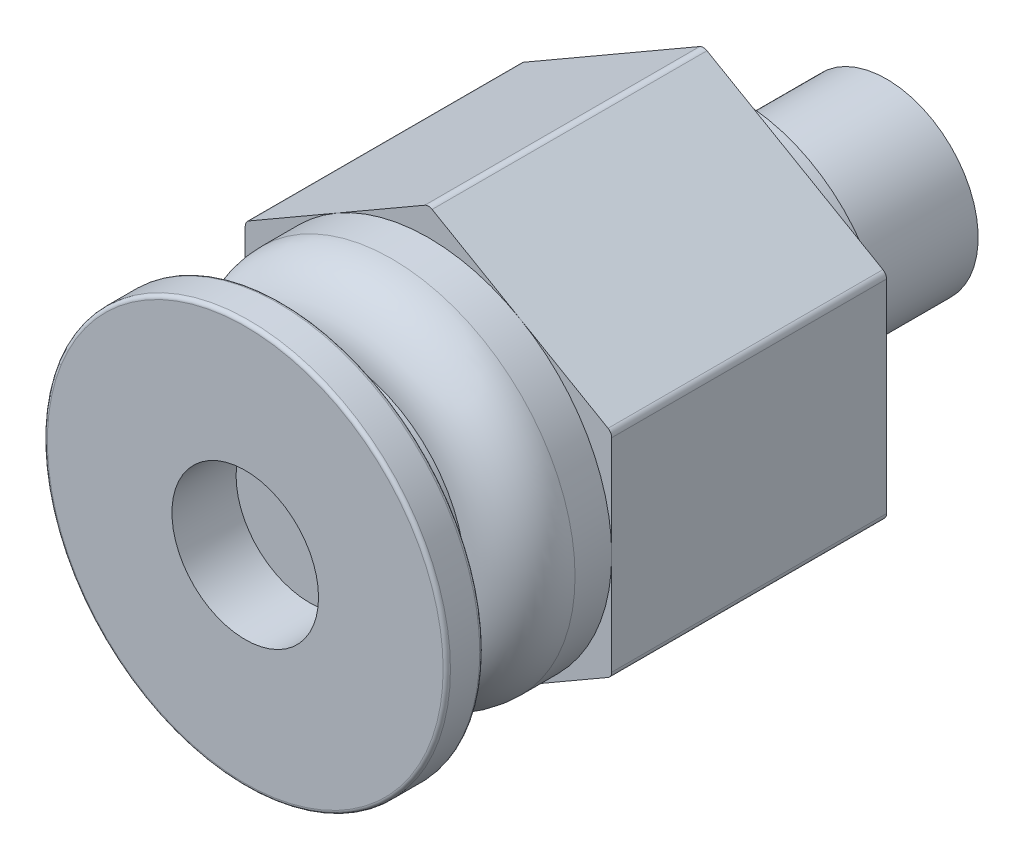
ISO-10303-21;
HEADER;
FILE_DESCRIPTION(('STEP AP214'),'2;1');
FILE_NAME('part.step','',(''),(''),'','','');
FILE_SCHEMA(('AUTOMOTIVE_DESIGN { 1 0 10303 214 1 1 1 1 }'));
ENDSEC;
DATA;
#1=APPLICATION_CONTEXT('core data for automotive mechanical design processes');
#2=APPLICATION_PROTOCOL_DEFINITION('international standard','automotive_design',2000,#1);
#3=PRODUCT_CONTEXT('',#1,'mechanical');
#4=PRODUCT('Part','Part','',(#3));
#5=PRODUCT_RELATED_PRODUCT_CATEGORY('part','',(#4));
#6=PRODUCT_DEFINITION_FORMATION('','',#4);
#7=PRODUCT_DEFINITION_CONTEXT('part definition',#1,'design');
#8=PRODUCT_DEFINITION('design','',#6,#7);
#9=PRODUCT_DEFINITION_SHAPE('','',#8);
#10=(LENGTH_UNIT() NAMED_UNIT(*) SI_UNIT(.MILLI.,.METRE.));
#11=(NAMED_UNIT(*) PLANE_ANGLE_UNIT() SI_UNIT($,.RADIAN.));
#12=(NAMED_UNIT(*) SI_UNIT($,.STERADIAN.) SOLID_ANGLE_UNIT());
#13=UNCERTAINTY_MEASURE_WITH_UNIT(LENGTH_MEASURE(1.E-05),#10,'distance_accuracy_value','');
#14=(GEOMETRIC_REPRESENTATION_CONTEXT(3) GLOBAL_UNCERTAINTY_ASSIGNED_CONTEXT((#13)) GLOBAL_UNIT_ASSIGNED_CONTEXT((#10,
#11,#12)) REPRESENTATION_CONTEXT('',''));
#15=CARTESIAN_POINT('',(0.,0.,0.));
#16=DIRECTION('',(0.,0.,1.));
#17=DIRECTION('',(1.,0.,0.));
#18=AXIS2_PLACEMENT_3D('',#15,#16,#17);
#19=CARTESIAN_POINT('',(0.,0.,0.));
#20=DIRECTION('',(0.,0.,-1.));
#21=DIRECTION('',(-1.,0.,0.));
#22=AXIS2_PLACEMENT_3D('',#19,#20,#21);
#23=PLANE('',#22);
#24=CARTESIAN_POINT('',(0.,0.,0.));
#25=DIRECTION('',(0.,0.,-1.));
#26=DIRECTION('',(1.,0.,0.));
#27=AXIS2_PLACEMENT_3D('',#24,#25,#26);
#28=CIRCLE('',#27,2.5);
#29=CARTESIAN_POINT('',(-2.5,0.,0.));
#30=VERTEX_POINT('',#29);
#31=EDGE_CURVE('E11',#30,#30,#28,.T.);
#32=ORIENTED_EDGE('',*,*,#31,.T.);
#33=EDGE_LOOP('',(#32));
#34=FACE_BOUND('',#33,.T.);
#35=CARTESIAN_POINT('',(0.,0.,0.));
#36=DIRECTION('',(0.,0.,1.));
#37=DIRECTION('',(1.,0.,0.));
#38=AXIS2_PLACEMENT_3D('',#35,#36,#37);
#39=CIRCLE('',#38,2.);
#40=CARTESIAN_POINT('',(-2.,0.,0.));
#41=VERTEX_POINT('',#40);
#42=EDGE_CURVE('E320',#41,#41,#39,.T.);
#43=ORIENTED_EDGE('',*,*,#42,.T.);
#44=EDGE_LOOP('',(#43));
#45=FACE_BOUND('',#44,.T.);
#46=ADVANCED_FACE('F16',(#34,#45),#23,.T.);
#47=CARTESIAN_POINT('',(0.,0.,2.));
#48=DIRECTION('',(0.,0.,1.));
#49=DIRECTION('',(-1.,0.,0.));
#50=AXIS2_PLACEMENT_3D('',#47,#48,#49);
#51=CYLINDRICAL_SURFACE('',#50,2.5);
#52=ORIENTED_EDGE('',*,*,#31,.F.);
#53=EDGE_LOOP('',(#52));
#54=FACE_BOUND('',#53,.T.);
#55=CARTESIAN_POINT('',(0.,0.,4.));
#56=DIRECTION('',(0.,0.,-1.));
#57=DIRECTION('',(1.,0.,0.));
#58=AXIS2_PLACEMENT_3D('',#55,#56,#57);
#59=CIRCLE('',#58,2.5);
#60=CARTESIAN_POINT('',(-2.5,0.,4.));
#61=VERTEX_POINT('',#60);
#62=EDGE_CURVE('E27',#61,#61,#59,.T.);
#63=ORIENTED_EDGE('',*,*,#62,.T.);
#64=EDGE_LOOP('',(#63));
#65=FACE_BOUND('',#64,.T.);
#66=ADVANCED_FACE('F659',(#54,#65),#51,.T.);
#67=CARTESIAN_POINT('',(-2.5,0.,4.));
#68=DIRECTION('',(0.,0.,-1.));
#69=DIRECTION('',(-1.,0.,0.));
#70=AXIS2_PLACEMENT_3D('',#67,#68,#69);
#71=PLANE('',#70);
#72=ORIENTED_EDGE('',*,*,#62,.F.);
#73=EDGE_LOOP('',(#72));
#74=FACE_BOUND('',#73,.T.);
#75=CARTESIAN_POINT('',(0.,0.,4.));
#76=DIRECTION('',(0.,0.,-1.));
#77=DIRECTION('',(1.,0.,0.));
#78=AXIS2_PLACEMENT_3D('',#75,#76,#77);
#79=CIRCLE('',#78,4.);
#80=CARTESIAN_POINT('',(-4.,0.,4.));
#81=VERTEX_POINT('',#80);
#82=EDGE_CURVE('E291',#81,#81,#79,.T.);
#83=ORIENTED_EDGE('',*,*,#82,.T.);
#84=EDGE_LOOP('',(#83));
#85=FACE_BOUND('',#84,.T.);
#86=ADVANCED_FACE('F632',(#74,#85),#71,.T.);
#87=CARTESIAN_POINT('',(0.,0.,4.5));
#88=DIRECTION('',(0.,0.,1.));
#89=DIRECTION('',(-1.,0.,0.));
#90=AXIS2_PLACEMENT_3D('',#87,#88,#89);
#91=CYLINDRICAL_SURFACE('',#90,4.);
#92=ORIENTED_EDGE('',*,*,#82,.F.);
#93=EDGE_LOOP('',(#92));
#94=FACE_BOUND('',#93,.T.);
#95=CARTESIAN_POINT('',(0.,0.,5.));
#96=DIRECTION('',(0.,0.,-1.));
#97=DIRECTION('',(1.,0.,0.));
#98=AXIS2_PLACEMENT_3D('',#95,#96,#97);
#99=CIRCLE('',#98,4.);
#100=CARTESIAN_POINT('',(-4.,0.,5.));
#101=VERTEX_POINT('',#100);
#102=EDGE_CURVE('E219',#101,#101,#99,.T.);
#103=ORIENTED_EDGE('',*,*,#102,.T.);
#104=EDGE_LOOP('',(#103));
#105=FACE_BOUND('',#104,.T.);
#106=ADVANCED_FACE('F628',(#94,#105),#91,.T.);
#107=CARTESIAN_POINT('',(-5.,-2.88675134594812,5.));
#108=DIRECTION('',(-0.5,-0.866025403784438,0.));
#109=DIRECTION('',(0.866025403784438,-0.5,0.));
#110=AXIS2_PLACEMENT_3D('',#107,#108,#109);
#111=PLANE('',#110);
#112=DIRECTION('',(0.,0.,1.));
#113=VECTOR('',#112,1.);
#114=CARTESIAN_POINT('',(-4.9,-2.94448637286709,5.));
#115=LINE('',#114,#113);
#116=CARTESIAN_POINT('',(-4.9,-2.94448637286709,5.));
#117=VERTEX_POINT('',#116);
#118=CARTESIAN_POINT('',(-4.9,-2.94448637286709,12.5));
#119=VERTEX_POINT('',#118);
#120=EDGE_CURVE('E214',#117,#119,#115,.T.);
#121=ORIENTED_EDGE('',*,*,#120,.F.);
#122=DIRECTION('',(-0.866025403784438,0.5,0.));
#123=VECTOR('',#122,1.);
#124=CARTESIAN_POINT('',(0.,-5.77350269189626,5.));
#125=LINE('',#124,#123);
#126=CARTESIAN_POINT('',(-0.100000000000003,-5.71576766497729,5.));
#127=VERTEX_POINT('',#126);
#128=EDGE_CURVE('E211',#127,#117,#125,.T.);
#129=ORIENTED_EDGE('',*,*,#128,.F.);
#130=DIRECTION('',(0.,0.,-1.));
#131=VECTOR('',#130,1.);
#132=CARTESIAN_POINT('',(-0.100000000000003,-5.71576766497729,5.));
#133=LINE('',#132,#131);
#134=CARTESIAN_POINT('',(-0.100000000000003,-5.71576766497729,12.5));
#135=VERTEX_POINT('',#134);
#136=EDGE_CURVE('E198',#135,#127,#133,.T.);
#137=ORIENTED_EDGE('',*,*,#136,.F.);
#138=DIRECTION('',(0.866025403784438,-0.5,0.));
#139=VECTOR('',#138,1.);
#140=CARTESIAN_POINT('',(0.,-5.77350269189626,12.5));
#141=LINE('',#140,#139);
#142=CARTESIAN_POINT('',(-2.5,-4.33012701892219,12.5));
#143=VERTEX_POINT('',#142);
#144=EDGE_CURVE('E119',#143,#135,#141,.T.);
#145=ORIENTED_EDGE('',*,*,#144,.F.);
#146=DIRECTION('',(0.866025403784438,-0.5,0.));
#147=VECTOR('',#146,1.);
#148=CARTESIAN_POINT('',(0.,-5.77350269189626,12.5));
#149=LINE('',#148,#147);
#150=EDGE_CURVE('E373',#119,#143,#149,.T.);
#151=ORIENTED_EDGE('',*,*,#150,.F.);
#152=EDGE_LOOP('',(#121,#129,#137,#145,#151));
#153=FACE_BOUND('',#152,.T.);
#154=ADVANCED_FACE('F212',(#153),#111,.T.);
#155=CARTESIAN_POINT('',(0.,0.,12.5));
#156=DIRECTION('',(0.,0.,1.));
#157=DIRECTION('',(1.,0.,0.));
#158=AXIS2_PLACEMENT_3D('',#155,#156,#157);
#159=PLANE('',#158);
#160=CARTESIAN_POINT('',(0.,-5.54256258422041,12.5));
#161=DIRECTION('',(0.,0.,-1.));
#162=DIRECTION('',(0.,-1.,0.));
#163=AXIS2_PLACEMENT_3D('',#160,#161,#162);
#164=CIRCLE('',#163,0.2);
#165=CARTESIAN_POINT('',(0.0999999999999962,-5.71576766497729,12.5));
#166=VERTEX_POINT('',#165);
#167=EDGE_CURVE('E205',#166,#135,#164,.T.);
#168=ORIENTED_EDGE('',*,*,#167,.F.);
#169=DIRECTION('',(0.866025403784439,0.5,0.));
#170=VECTOR('',#169,1.);
#171=CARTESIAN_POINT('',(5.,-2.88675134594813,12.5));
#172=LINE('',#171,#170);
#173=CARTESIAN_POINT('',(2.5,-4.3301270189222,12.5));
#174=VERTEX_POINT('',#173);
#175=EDGE_CURVE('E311',#166,#174,#172,.T.);
#176=ORIENTED_EDGE('',*,*,#175,.T.);
#177=CARTESIAN_POINT('',(0.,0.,12.5));
#178=DIRECTION('',(0.,0.,-1.));
#179=DIRECTION('',(-1.,0.,0.));
#180=AXIS2_PLACEMENT_3D('',#177,#178,#179);
#181=CIRCLE('',#180,5.);
#182=EDGE_CURVE('E268',#174,#143,#181,.T.);
#183=ORIENTED_EDGE('',*,*,#182,.T.);
#184=ORIENTED_EDGE('',*,*,#144,.T.);
#185=EDGE_LOOP('',(#168,#176,#183,#184));
#186=FACE_BOUND('',#185,.T.);
#187=ADVANCED_FACE('F574',(#186),#159,.T.);
#188=CARTESIAN_POINT('',(0.,0.,12.5));
#189=DIRECTION('',(0.,0.,1.));
#190=DIRECTION('',(1.,0.,0.));
#191=AXIS2_PLACEMENT_3D('',#188,#189,#190);
#192=PLANE('',#191);
#193=CARTESIAN_POINT('',(4.8,-2.77128129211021,12.5));
#194=DIRECTION('',(0.,0.,-1.));
#195=DIRECTION('',(0.866025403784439,-0.5,0.));
#196=AXIS2_PLACEMENT_3D('',#193,#194,#195);
#197=CIRCLE('',#196,0.2);
#198=CARTESIAN_POINT('',(5.,-2.77128129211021,12.5));
#199=VERTEX_POINT('',#198);
#200=CARTESIAN_POINT('',(4.9,-2.94448637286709,12.5));
#201=VERTEX_POINT('',#200);
#202=EDGE_CURVE('E234',#199,#201,#197,.T.);
#203=ORIENTED_EDGE('',*,*,#202,.F.);
#204=DIRECTION('',(0.,1.,0.));
#205=VECTOR('',#204,1.);
#206=CARTESIAN_POINT('',(5.,2.88675134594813,12.5));
#207=LINE('',#206,#205);
#208=CARTESIAN_POINT('',(5.,0.,12.5));
#209=VERTEX_POINT('',#208);
#210=EDGE_CURVE('E253',#199,#209,#207,.T.);
#211=ORIENTED_EDGE('',*,*,#210,.T.);
#212=CARTESIAN_POINT('',(0.,0.,12.5));
#213=DIRECTION('',(0.,0.,-1.));
#214=DIRECTION('',(-1.,0.,0.));
#215=AXIS2_PLACEMENT_3D('',#212,#213,#214);
#216=CIRCLE('',#215,5.);
#217=EDGE_CURVE('E264',#209,#174,#216,.T.);
#218=ORIENTED_EDGE('',*,*,#217,.T.);
#219=DIRECTION('',(0.866025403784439,0.5,0.));
#220=VECTOR('',#219,1.);
#221=CARTESIAN_POINT('',(5.,-2.88675134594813,12.5));
#222=LINE('',#221,#220);
#223=EDGE_CURVE('E307',#174,#201,#222,.T.);
#224=ORIENTED_EDGE('',*,*,#223,.T.);
#225=EDGE_LOOP('',(#203,#211,#218,#224));
#226=FACE_BOUND('',#225,.T.);
#227=ADVANCED_FACE('F18',(#226),#192,.T.);
#228=CARTESIAN_POINT('',(0.,0.,12.5));
#229=DIRECTION('',(0.,0.,-1.));
#230=DIRECTION('',(-1.,0.,0.));
#231=AXIS2_PLACEMENT_3D('',#228,#229,#230);
#232=CYLINDRICAL_SURFACE('',#231,5.);
#233=CARTESIAN_POINT('',(0.,0.,13.5));
#234=DIRECTION('',(0.,0.,1.));
#235=DIRECTION('',(-1.,0.,0.));
#236=AXIS2_PLACEMENT_3D('',#233,#234,#235);
#237=CIRCLE('',#236,5.);
#238=CARTESIAN_POINT('',(5.,0.,13.5));
#239=VERTEX_POINT('',#238);
#240=EDGE_CURVE('E269',#239,#239,#237,.T.);
#241=ORIENTED_EDGE('',*,*,#240,.F.);
#242=EDGE_LOOP('',(#241));
#243=FACE_BOUND('',#242,.T.);
#244=ORIENTED_EDGE('',*,*,#217,.F.);
#245=CARTESIAN_POINT('',(0.,0.,12.5));
#246=DIRECTION('',(0.,0.,-1.));
#247=DIRECTION('',(-1.,0.,0.));
#248=AXIS2_PLACEMENT_3D('',#245,#246,#247);
#249=CIRCLE('',#248,5.);
#250=CARTESIAN_POINT('',(2.5,4.3301270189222,12.5));
#251=VERTEX_POINT('',#250);
#252=EDGE_CURVE('E254',#251,#209,#249,.T.);
#253=ORIENTED_EDGE('',*,*,#252,.F.);
#254=CARTESIAN_POINT('',(0.,0.,12.5));
#255=DIRECTION('',(0.,0.,-1.));
#256=DIRECTION('',(-1.,0.,0.));
#257=AXIS2_PLACEMENT_3D('',#254,#255,#256);
#258=CIRCLE('',#257,5.);
#259=CARTESIAN_POINT('',(-2.5,4.3301270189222,12.5));
#260=VERTEX_POINT('',#259);
#261=EDGE_CURVE('E278',#260,#251,#258,.T.);
#262=ORIENTED_EDGE('',*,*,#261,.F.);
#263=CARTESIAN_POINT('',(0.,0.,12.5));
#264=DIRECTION('',(0.,0.,-1.));
#265=DIRECTION('',(-1.,0.,0.));
#266=AXIS2_PLACEMENT_3D('',#263,#264,#265);
#267=CIRCLE('',#266,5.);
#268=CARTESIAN_POINT('',(-5.,0.,12.5));
#269=VERTEX_POINT('',#268);
#270=EDGE_CURVE('E246',#269,#260,#267,.T.);
#271=ORIENTED_EDGE('',*,*,#270,.F.);
#272=CARTESIAN_POINT('',(0.,0.,12.5));
#273=DIRECTION('',(0.,0.,-1.));
#274=DIRECTION('',(-1.,0.,0.));
#275=AXIS2_PLACEMENT_3D('',#272,#273,#274);
#276=CIRCLE('',#275,5.);
#277=EDGE_CURVE('E351',#143,#269,#276,.T.);
#278=ORIENTED_EDGE('',*,*,#277,.F.);
#279=ORIENTED_EDGE('',*,*,#182,.F.);
#280=EDGE_LOOP('',(#244,#253,#262,#271,#278,#279));
#281=FACE_BOUND('',#280,.T.);
#282=ADVANCED_FACE('F426',(#243,#281),#232,.T.);
#283=CARTESIAN_POINT('',(0.,0.,13.5));
#284=DIRECTION('',(0.,0.,1.));
#285=DIRECTION('',(1.,0.,0.));
#286=AXIS2_PLACEMENT_3D('',#283,#284,#285);
#287=TOROIDAL_SURFACE('',#286,3.5,1.5);
#288=CARTESIAN_POINT('',(0.,0.,15.));
#289=DIRECTION('',(0.,0.,-1.));
#290=DIRECTION('',(-1.,0.,0.));
#291=AXIS2_PLACEMENT_3D('',#288,#289,#290);
#292=CIRCLE('',#291,3.5);
#293=CARTESIAN_POINT('',(3.5,0.,15.));
#294=VERTEX_POINT('',#293);
#295=EDGE_CURVE('E171',#294,#294,#292,.T.);
#296=ORIENTED_EDGE('',*,*,#295,.T.);
#297=EDGE_LOOP('',(#296));
#298=FACE_BOUND('',#297,.T.);
#299=ORIENTED_EDGE('',*,*,#240,.T.);
#300=EDGE_LOOP('',(#299));
#301=FACE_BOUND('',#300,.T.);
#302=ADVANCED_FACE('F424',(#298,#301),#287,.T.);
#303=CARTESIAN_POINT('',(0.,0.,15.));
#304=DIRECTION('',(0.,0.,-1.));
#305=DIRECTION('',(-1.,0.,0.));
#306=AXIS2_PLACEMENT_3D('',#303,#304,#305);
#307=CYLINDRICAL_SURFACE('',#306,2.5);
#308=CARTESIAN_POINT('',(0.,0.,16.5));
#309=DIRECTION('',(0.,0.,1.));
#310=DIRECTION('',(-1.,0.,0.));
#311=AXIS2_PLACEMENT_3D('',#308,#309,#310);
#312=CIRCLE('',#311,2.5);
#313=CARTESIAN_POINT('',(2.5,0.,16.5));
#314=VERTEX_POINT('',#313);
#315=EDGE_CURVE('E298',#314,#314,#312,.T.);
#316=ORIENTED_EDGE('',*,*,#315,.F.);
#317=EDGE_LOOP('',(#316));
#318=FACE_BOUND('',#317,.T.);
#319=CARTESIAN_POINT('',(0.,0.,15.75));
#320=DIRECTION('',(0.,0.,1.));
#321=DIRECTION('',(-1.,0.,0.));
#322=AXIS2_PLACEMENT_3D('',#319,#320,#321);
#323=CIRCLE('',#322,2.5);
#324=CARTESIAN_POINT('',(2.5,0.,15.75));
#325=VERTEX_POINT('',#324);
#326=EDGE_CURVE('E261',#325,#325,#323,.T.);
#327=ORIENTED_EDGE('',*,*,#326,.T.);
#328=EDGE_LOOP('',(#327));
#329=FACE_BOUND('',#328,.T.);
#330=ADVANCED_FACE('F615',(#318,#329),#307,.T.);
#331=CARTESIAN_POINT('',(0.,0.,-6.17664109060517));
#332=DIRECTION('',(0.,0.,-1.));
#333=DIRECTION('',(1.,0.,0.));
#334=AXIS2_PLACEMENT_3D('',#331,#332,#333);
#335=CYLINDRICAL_SURFACE('',#334,2.);
#336=ORIENTED_EDGE('',*,*,#42,.F.);
#337=EDGE_LOOP('',(#336));
#338=FACE_BOUND('',#337,.T.);
#339=CARTESIAN_POINT('',(0.,0.,15.));
#340=DIRECTION('',(0.,0.,1.));
#341=DIRECTION('',(1.,0.,0.));
#342=AXIS2_PLACEMENT_3D('',#339,#340,#341);
#343=CIRCLE('',#342,2.);
#344=CARTESIAN_POINT('',(-2.,0.,15.));
#345=VERTEX_POINT('',#344);
#346=EDGE_CURVE('E342',#345,#345,#343,.T.);
#347=ORIENTED_EDGE('',*,*,#346,.T.);
#348=EDGE_LOOP('',(#347));
#349=FACE_BOUND('',#348,.T.);
#350=ADVANCED_FACE('F620',(#338,#349),#335,.F.);
#351=CARTESIAN_POINT('',(0.,0.,17.5));
#352=DIRECTION('',(0.,0.,1.));
#353=DIRECTION('',(1.,0.,0.));
#354=AXIS2_PLACEMENT_3D('',#351,#352,#353);
#355=PLANE('',#354);
#356=CARTESIAN_POINT('',(0.,0.,17.5));
#357=DIRECTION('',(0.,0.,-1.));
#358=DIRECTION('',(-1.,0.,0.));
#359=AXIS2_PLACEMENT_3D('',#356,#357,#358);
#360=CIRCLE('',#359,5.4);
#361=CARTESIAN_POINT('',(5.4,0.,17.5));
#362=VERTEX_POINT('',#361);
#363=EDGE_CURVE('E323',#362,#362,#360,.T.);
#364=ORIENTED_EDGE('',*,*,#363,.F.);
#365=EDGE_LOOP('',(#364));
#366=FACE_BOUND('',#365,.T.);
#367=CARTESIAN_POINT('',(0.,0.,17.5));
#368=DIRECTION('',(0.,0.,-1.));
#369=DIRECTION('',(1.,0.,0.));
#370=AXIS2_PLACEMENT_3D('',#367,#368,#369);
#371=CIRCLE('',#370,2.);
#372=CARTESIAN_POINT('',(2.,0.,17.5));
#373=VERTEX_POINT('',#372);
#374=EDGE_CURVE('E176',#373,#373,#371,.T.);
#375=ORIENTED_EDGE('',*,*,#374,.T.);
#376=EDGE_LOOP('',(#375));
#377=FACE_BOUND('',#376,.T.);
#378=ADVANCED_FACE('F683',(#366,#377),#355,.T.);
#379=CARTESIAN_POINT('',(0.,0.,17.4));
#380=DIRECTION('',(0.,0.,1.));
#381=DIRECTION('',(1.,0.,0.));
#382=AXIS2_PLACEMENT_3D('',#379,#380,#381);
#383=TOROIDAL_SURFACE('',#382,5.4,0.1);
#384=ORIENTED_EDGE('',*,*,#363,.T.);
#385=EDGE_LOOP('',(#384));
#386=FACE_BOUND('',#385,.T.);
#387=CARTESIAN_POINT('',(0.,0.,17.4));
#388=DIRECTION('',(0.,0.,1.));
#389=DIRECTION('',(-1.,0.,0.));
#390=AXIS2_PLACEMENT_3D('',#387,#388,#389);
#391=CIRCLE('',#390,5.5);
#392=CARTESIAN_POINT('',(5.5,0.,17.4));
#393=VERTEX_POINT('',#392);
#394=EDGE_CURVE('E295',#393,#393,#391,.T.);
#395=ORIENTED_EDGE('',*,*,#394,.T.);
#396=EDGE_LOOP('',(#395));
#397=FACE_BOUND('',#396,.T.);
#398=ADVANCED_FACE('F687',(#386,#397),#383,.T.);
#399=CARTESIAN_POINT('',(0.,0.,16.5));
#400=DIRECTION('',(0.,0.,1.));
#401=DIRECTION('',(1.,0.,0.));
#402=AXIS2_PLACEMENT_3D('',#399,#400,#401);
#403=PLANE('',#402);
#404=CARTESIAN_POINT('',(0.,0.,16.5));
#405=DIRECTION('',(0.,0.,1.));
#406=DIRECTION('',(-1.,0.,0.));
#407=AXIS2_PLACEMENT_3D('',#404,#405,#406);
#408=CIRCLE('',#407,5.4);
#409=CARTESIAN_POINT('',(5.4,0.,16.5));
#410=VERTEX_POINT('',#409);
#411=EDGE_CURVE('E294',#410,#410,#408,.T.);
#412=ORIENTED_EDGE('',*,*,#411,.F.);
#413=EDGE_LOOP('',(#412));
#414=FACE_BOUND('',#413,.T.);
#415=ORIENTED_EDGE('',*,*,#315,.T.);
#416=EDGE_LOOP('',(#415));
#417=FACE_BOUND('',#416,.T.);
#418=ADVANCED_FACE('F796',(#414,#417),#403,.F.);
#419=CARTESIAN_POINT('',(0.,0.,16.5));
#420=DIRECTION('',(0.,0.,-1.));
#421=DIRECTION('',(-1.,0.,0.));
#422=AXIS2_PLACEMENT_3D('',#419,#420,#421);
#423=CYLINDRICAL_SURFACE('',#422,5.5);
#424=CARTESIAN_POINT('',(0.,0.,16.6));
#425=DIRECTION('',(0.,0.,-1.));
#426=DIRECTION('',(-1.,0.,0.));
#427=AXIS2_PLACEMENT_3D('',#424,#425,#426);
#428=CIRCLE('',#427,5.5);
#429=CARTESIAN_POINT('',(5.5,0.,16.6));
#430=VERTEX_POINT('',#429);
#431=EDGE_CURVE('E111',#430,#430,#428,.T.);
#432=ORIENTED_EDGE('',*,*,#431,.F.);
#433=EDGE_LOOP('',(#432));
#434=FACE_BOUND('',#433,.T.);
#435=ORIENTED_EDGE('',*,*,#394,.F.);
#436=EDGE_LOOP('',(#435));
#437=FACE_BOUND('',#436,.T.);
#438=ADVANCED_FACE('F786',(#434,#437),#423,.T.);
#439=CARTESIAN_POINT('',(0.,0.,16.6));
#440=DIRECTION('',(0.,0.,-1.));
#441=DIRECTION('',(-1.,0.,0.));
#442=AXIS2_PLACEMENT_3D('',#439,#440,#441);
#443=TOROIDAL_SURFACE('',#442,5.4,0.1);
#444=ORIENTED_EDGE('',*,*,#411,.T.);
#445=EDGE_LOOP('',(#444));
#446=FACE_BOUND('',#445,.T.);
#447=ORIENTED_EDGE('',*,*,#431,.T.);
#448=EDGE_LOOP('',(#447));
#449=FACE_BOUND('',#448,.T.);
#450=ADVANCED_FACE('F777',(#446,#449),#443,.T.);
#451=CARTESIAN_POINT('',(0.,-5.54256258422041,5.));
#452=DIRECTION('',(0.,0.,-1.));
#453=DIRECTION('',(0.,-1.,0.));
#454=AXIS2_PLACEMENT_3D('',#451,#452,#453);
#455=CYLINDRICAL_SURFACE('',#454,0.2);
#456=ORIENTED_EDGE('',*,*,#167,.T.);
#457=ORIENTED_EDGE('',*,*,#136,.T.);
#458=CARTESIAN_POINT('',(0.,-5.54256258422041,5.));
#459=DIRECTION('',(0.,0.,1.));
#460=DIRECTION('',(0.,-1.,0.));
#461=AXIS2_PLACEMENT_3D('',#458,#459,#460);
#462=CIRCLE('',#461,0.2);
#463=CARTESIAN_POINT('',(0.0999999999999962,-5.71576766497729,5.));
#464=VERTEX_POINT('',#463);
#465=EDGE_CURVE('E203',#127,#464,#462,.T.);
#466=ORIENTED_EDGE('',*,*,#465,.T.);
#467=DIRECTION('',(0.,0.,1.));
#468=VECTOR('',#467,1.);
#469=CARTESIAN_POINT('',(0.0999999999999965,-5.71576766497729,5.));
#470=LINE('',#469,#468);
#471=EDGE_CURVE('E272',#464,#166,#470,.T.);
#472=ORIENTED_EDGE('',*,*,#471,.T.);
#473=EDGE_LOOP('',(#456,#457,#466,#472));
#474=FACE_BOUND('',#473,.T.);
#475=ADVANCED_FACE('F200',(#474),#455,.T.);
#476=CARTESIAN_POINT('',(0.,-5.77350269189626,5.));
#477=DIRECTION('',(0.5,-0.866025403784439,0.));
#478=DIRECTION('',(0.866025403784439,0.5,0.));
#479=AXIS2_PLACEMENT_3D('',#476,#477,#478);
#480=PLANE('',#479);
#481=DIRECTION('',(0.,0.,-1.));
#482=VECTOR('',#481,1.);
#483=CARTESIAN_POINT('',(4.9,-2.94448637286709,5.));
#484=LINE('',#483,#482);
#485=CARTESIAN_POINT('',(4.9,-2.94448637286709,5.));
#486=VERTEX_POINT('',#485);
#487=EDGE_CURVE('E380',#201,#486,#484,.T.);
#488=ORIENTED_EDGE('',*,*,#487,.F.);
#489=ORIENTED_EDGE('',*,*,#223,.F.);
#490=ORIENTED_EDGE('',*,*,#175,.F.);
#491=ORIENTED_EDGE('',*,*,#471,.F.);
#492=DIRECTION('',(-0.866025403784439,-0.5,0.));
#493=VECTOR('',#492,1.);
#494=CARTESIAN_POINT('',(5.,-2.88675134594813,5.));
#495=LINE('',#494,#493);
#496=EDGE_CURVE('E224',#486,#464,#495,.T.);
#497=ORIENTED_EDGE('',*,*,#496,.F.);
#498=EDGE_LOOP('',(#488,#489,#490,#491,#497));
#499=FACE_BOUND('',#498,.T.);
#500=ADVANCED_FACE('F401',(#499),#480,.T.);
#501=CARTESIAN_POINT('',(0.,0.,5.));
#502=DIRECTION('',(0.,0.,1.));
#503=DIRECTION('',(1.,0.,0.));
#504=AXIS2_PLACEMENT_3D('',#501,#502,#503);
#505=PLANE('',#504);
#506=ORIENTED_EDGE('',*,*,#102,.F.);
#507=EDGE_LOOP('',(#506));
#508=FACE_BOUND('',#507,.T.);
#509=CARTESIAN_POINT('',(-4.8,-2.7712812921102,5.));
#510=DIRECTION('',(0.,0.,1.));
#511=DIRECTION('',(-0.866025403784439,-0.5,0.));
#512=AXIS2_PLACEMENT_3D('',#509,#510,#511);
#513=CIRCLE('',#512,0.2);
#514=CARTESIAN_POINT('',(-5.,-2.7712812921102,5.));
#515=VERTEX_POINT('',#514);
#516=EDGE_CURVE('E339',#515,#117,#513,.T.);
#517=ORIENTED_EDGE('',*,*,#516,.F.);
#518=DIRECTION('',(0.,1.,0.));
#519=VECTOR('',#518,1.);
#520=CARTESIAN_POINT('',(-5.,-2.88675134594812,5.));
#521=LINE('',#520,#519);
#522=CARTESIAN_POINT('',(-5.,2.77128129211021,5.));
#523=VERTEX_POINT('',#522);
#524=EDGE_CURVE('E369',#515,#523,#521,.T.);
#525=ORIENTED_EDGE('',*,*,#524,.T.);
#526=CARTESIAN_POINT('',(-4.8,2.77128129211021,5.));
#527=DIRECTION('',(0.,0.,1.));
#528=DIRECTION('',(-0.866025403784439,0.5,0.));
#529=AXIS2_PLACEMENT_3D('',#526,#527,#528);
#530=CIRCLE('',#529,0.2);
#531=CARTESIAN_POINT('',(-4.9,2.94448637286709,5.));
#532=VERTEX_POINT('',#531);
#533=EDGE_CURVE('E324',#532,#523,#530,.T.);
#534=ORIENTED_EDGE('',*,*,#533,.F.);
#535=DIRECTION('',(0.866025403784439,0.5,0.));
#536=VECTOR('',#535,1.);
#537=CARTESIAN_POINT('',(-5.,2.88675134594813,5.));
#538=LINE('',#537,#536);
#539=CARTESIAN_POINT('',(-0.1,5.71576766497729,5.));
#540=VERTEX_POINT('',#539);
#541=EDGE_CURVE('E242',#532,#540,#538,.T.);
#542=ORIENTED_EDGE('',*,*,#541,.T.);
#543=CARTESIAN_POINT('',(0.,5.54256258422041,5.));
#544=DIRECTION('',(0.,0.,1.));
#545=DIRECTION('',(0.,1.,0.));
#546=AXIS2_PLACEMENT_3D('',#543,#544,#545);
#547=CIRCLE('',#546,0.2);
#548=CARTESIAN_POINT('',(0.1,5.71576766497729,5.));
#549=VERTEX_POINT('',#548);
#550=EDGE_CURVE('E333',#549,#540,#547,.T.);
#551=ORIENTED_EDGE('',*,*,#550,.F.);
#552=DIRECTION('',(0.866025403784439,-0.5,0.));
#553=VECTOR('',#552,1.);
#554=CARTESIAN_POINT('',(0.,5.77350269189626,5.));
#555=LINE('',#554,#553);
#556=CARTESIAN_POINT('',(4.9,2.94448637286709,5.));
#557=VERTEX_POINT('',#556);
#558=EDGE_CURVE('E283',#549,#557,#555,.T.);
#559=ORIENTED_EDGE('',*,*,#558,.T.);
#560=CARTESIAN_POINT('',(4.8,2.77128129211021,5.));
#561=DIRECTION('',(0.,0.,1.));
#562=DIRECTION('',(0.866025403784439,0.5,0.));
#563=AXIS2_PLACEMENT_3D('',#560,#561,#562);
#564=CIRCLE('',#563,0.2);
#565=CARTESIAN_POINT('',(5.,2.77128129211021,5.));
#566=VERTEX_POINT('',#565);
#567=EDGE_CURVE('E366',#566,#557,#564,.T.);
#568=ORIENTED_EDGE('',*,*,#567,.F.);
#569=DIRECTION('',(0.,-1.,0.));
#570=VECTOR('',#569,1.);
#571=CARTESIAN_POINT('',(5.,2.88675134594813,5.));
#572=LINE('',#571,#570);
#573=CARTESIAN_POINT('',(5.,-2.77128129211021,5.));
#574=VERTEX_POINT('',#573);
#575=EDGE_CURVE('E252',#566,#574,#572,.T.);
#576=ORIENTED_EDGE('',*,*,#575,.T.);
#577=CARTESIAN_POINT('',(4.8,-2.77128129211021,5.));
#578=DIRECTION('',(0.,0.,1.));
#579=DIRECTION('',(0.866025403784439,-0.5,0.));
#580=AXIS2_PLACEMENT_3D('',#577,#578,#579);
#581=CIRCLE('',#580,0.2);
#582=EDGE_CURVE('E230',#486,#574,#581,.T.);
#583=ORIENTED_EDGE('',*,*,#582,.F.);
#584=ORIENTED_EDGE('',*,*,#496,.T.);
#585=ORIENTED_EDGE('',*,*,#465,.F.);
#586=ORIENTED_EDGE('',*,*,#128,.T.);
#587=EDGE_LOOP('',(#517,#525,#534,#542,#551,#559,#568,#576,#583,#584,#585,#586));
#588=FACE_BOUND('',#587,.T.);
#589=ADVANCED_FACE('F221',(#508,#588),#505,.F.);
#590=CARTESIAN_POINT('',(4.8,-2.77128129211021,5.));
#591=DIRECTION('',(0.,0.,-1.));
#592=DIRECTION('',(0.866025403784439,-0.5,0.));
#593=AXIS2_PLACEMENT_3D('',#590,#591,#592);
#594=CYLINDRICAL_SURFACE('',#593,0.2);
#595=ORIENTED_EDGE('',*,*,#202,.T.);
#596=ORIENTED_EDGE('',*,*,#487,.T.);
#597=ORIENTED_EDGE('',*,*,#582,.T.);
#598=DIRECTION('',(0.,0.,1.));
#599=VECTOR('',#598,1.);
#600=CARTESIAN_POINT('',(5.,-2.77128129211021,5.));
#601=LINE('',#600,#599);
#602=EDGE_CURVE('E248',#574,#199,#601,.T.);
#603=ORIENTED_EDGE('',*,*,#602,.T.);
#604=EDGE_LOOP('',(#595,#596,#597,#603));
#605=FACE_BOUND('',#604,.T.);
#606=ADVANCED_FACE('F391',(#605),#594,.T.);
#607=CARTESIAN_POINT('',(0.,0.,12.5));
#608=DIRECTION('',(0.,0.,1.));
#609=DIRECTION('',(1.,0.,0.));
#610=AXIS2_PLACEMENT_3D('',#607,#608,#609);
#611=PLANE('',#610);
#612=CARTESIAN_POINT('',(4.8,2.77128129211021,12.5));
#613=DIRECTION('',(0.,0.,-1.));
#614=DIRECTION('',(0.866025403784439,0.5,0.));
#615=AXIS2_PLACEMENT_3D('',#612,#613,#614);
#616=CIRCLE('',#615,0.2);
#617=CARTESIAN_POINT('',(4.9,2.94448637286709,12.5));
#618=VERTEX_POINT('',#617);
#619=CARTESIAN_POINT('',(5.,2.77128129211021,12.5));
#620=VERTEX_POINT('',#619);
#621=EDGE_CURVE('E273',#618,#620,#616,.T.);
#622=ORIENTED_EDGE('',*,*,#621,.F.);
#623=DIRECTION('',(-0.866025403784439,0.5,0.));
#624=VECTOR('',#623,1.);
#625=CARTESIAN_POINT('',(0.,5.77350269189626,12.5));
#626=LINE('',#625,#624);
#627=EDGE_CURVE('E284',#618,#251,#626,.T.);
#628=ORIENTED_EDGE('',*,*,#627,.T.);
#629=ORIENTED_EDGE('',*,*,#252,.T.);
#630=DIRECTION('',(0.,1.,0.));
#631=VECTOR('',#630,1.);
#632=CARTESIAN_POINT('',(5.,2.88675134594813,12.5));
#633=LINE('',#632,#631);
#634=EDGE_CURVE('E359',#209,#620,#633,.T.);
#635=ORIENTED_EDGE('',*,*,#634,.T.);
#636=EDGE_LOOP('',(#622,#628,#629,#635));
#637=FACE_BOUND('',#636,.T.);
#638=ADVANCED_FACE('F433',(#637),#611,.T.);
#639=CARTESIAN_POINT('',(5.,-2.88675134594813,5.));
#640=DIRECTION('',(1.,0.,0.));
#641=DIRECTION('',(0.,1.,0.));
#642=AXIS2_PLACEMENT_3D('',#639,#640,#641);
#643=PLANE('',#642);
#644=DIRECTION('',(0.,0.,-1.));
#645=VECTOR('',#644,1.);
#646=CARTESIAN_POINT('',(5.,2.77128129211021,5.));
#647=LINE('',#646,#645);
#648=EDGE_CURVE('E277',#620,#566,#647,.T.);
#649=ORIENTED_EDGE('',*,*,#648,.F.);
#650=ORIENTED_EDGE('',*,*,#634,.F.);
#651=ORIENTED_EDGE('',*,*,#210,.F.);
#652=ORIENTED_EDGE('',*,*,#602,.F.);
#653=ORIENTED_EDGE('',*,*,#575,.F.);
#654=EDGE_LOOP('',(#649,#650,#651,#652,#653));
#655=FACE_BOUND('',#654,.T.);
#656=ADVANCED_FACE('F707',(#655),#643,.T.);
#657=CARTESIAN_POINT('',(4.8,2.77128129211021,5.));
#658=DIRECTION('',(0.,0.,-1.));
#659=DIRECTION('',(0.866025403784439,0.5,0.));
#660=AXIS2_PLACEMENT_3D('',#657,#658,#659);
#661=CYLINDRICAL_SURFACE('',#660,0.2);
#662=ORIENTED_EDGE('',*,*,#621,.T.);
#663=ORIENTED_EDGE('',*,*,#648,.T.);
#664=ORIENTED_EDGE('',*,*,#567,.T.);
#665=DIRECTION('',(0.,0.,1.));
#666=VECTOR('',#665,1.);
#667=CARTESIAN_POINT('',(4.9,2.94448637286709,5.));
#668=LINE('',#667,#666);
#669=EDGE_CURVE('E279',#557,#618,#668,.T.);
#670=ORIENTED_EDGE('',*,*,#669,.T.);
#671=EDGE_LOOP('',(#662,#663,#664,#670));
#672=FACE_BOUND('',#671,.T.);
#673=ADVANCED_FACE('F559',(#672),#661,.T.);
#674=CARTESIAN_POINT('',(0.,0.,12.5));
#675=DIRECTION('',(0.,0.,1.));
#676=DIRECTION('',(1.,0.,0.));
#677=AXIS2_PLACEMENT_3D('',#674,#675,#676);
#678=PLANE('',#677);
#679=CARTESIAN_POINT('',(0.,5.54256258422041,12.5));
#680=DIRECTION('',(0.,0.,-1.));
#681=DIRECTION('',(0.,1.,0.));
#682=AXIS2_PLACEMENT_3D('',#679,#680,#681);
#683=CIRCLE('',#682,0.2);
#684=CARTESIAN_POINT('',(-0.1,5.71576766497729,12.5));
#685=VERTEX_POINT('',#684);
#686=CARTESIAN_POINT('',(0.1,5.71576766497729,12.5));
#687=VERTEX_POINT('',#686);
#688=EDGE_CURVE('E288',#685,#687,#683,.T.);
#689=ORIENTED_EDGE('',*,*,#688,.F.);
#690=DIRECTION('',(-0.866025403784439,-0.5,0.));
#691=VECTOR('',#690,1.);
#692=CARTESIAN_POINT('',(-5.,2.88675134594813,12.5));
#693=LINE('',#692,#691);
#694=EDGE_CURVE('E449',#685,#260,#693,.T.);
#695=ORIENTED_EDGE('',*,*,#694,.T.);
#696=ORIENTED_EDGE('',*,*,#261,.T.);
#697=DIRECTION('',(-0.866025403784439,0.5,0.));
#698=VECTOR('',#697,1.);
#699=CARTESIAN_POINT('',(0.,5.77350269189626,12.5));
#700=LINE('',#699,#698);
#701=EDGE_CURVE('E360',#251,#687,#700,.T.);
#702=ORIENTED_EDGE('',*,*,#701,.T.);
#703=EDGE_LOOP('',(#689,#695,#696,#702));
#704=FACE_BOUND('',#703,.T.);
#705=ADVANCED_FACE('F445',(#704),#678,.T.);
#706=CARTESIAN_POINT('',(5.,2.88675134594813,5.));
#707=DIRECTION('',(0.5,0.866025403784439,0.));
#708=DIRECTION('',(-0.866025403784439,0.5,0.));
#709=AXIS2_PLACEMENT_3D('',#706,#707,#708);
#710=PLANE('',#709);
#711=DIRECTION('',(0.,0.,-1.));
#712=VECTOR('',#711,1.);
#713=CARTESIAN_POINT('',(0.1,5.71576766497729,5.));
#714=LINE('',#713,#712);
#715=EDGE_CURVE('E329',#687,#549,#714,.T.);
#716=ORIENTED_EDGE('',*,*,#715,.F.);
#717=ORIENTED_EDGE('',*,*,#701,.F.);
#718=ORIENTED_EDGE('',*,*,#627,.F.);
#719=ORIENTED_EDGE('',*,*,#669,.F.);
#720=ORIENTED_EDGE('',*,*,#558,.F.);
#721=EDGE_LOOP('',(#716,#717,#718,#719,#720));
#722=FACE_BOUND('',#721,.T.);
#723=ADVANCED_FACE('F442',(#722),#710,.T.);
#724=CARTESIAN_POINT('',(0.,5.54256258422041,5.));
#725=DIRECTION('',(0.,0.,-1.));
#726=DIRECTION('',(0.,1.,0.));
#727=AXIS2_PLACEMENT_3D('',#724,#725,#726);
#728=CYLINDRICAL_SURFACE('',#727,0.2);
#729=ORIENTED_EDGE('',*,*,#688,.T.);
#730=ORIENTED_EDGE('',*,*,#715,.T.);
#731=ORIENTED_EDGE('',*,*,#550,.T.);
#732=DIRECTION('',(0.,0.,1.));
#733=VECTOR('',#732,1.);
#734=CARTESIAN_POINT('',(-0.1,5.71576766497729,5.));
#735=LINE('',#734,#733);
#736=EDGE_CURVE('E247',#540,#685,#735,.T.);
#737=ORIENTED_EDGE('',*,*,#736,.T.);
#738=EDGE_LOOP('',(#729,#730,#731,#737));
#739=FACE_BOUND('',#738,.T.);
#740=ADVANCED_FACE('F677',(#739),#728,.T.);
#741=CARTESIAN_POINT('',(0.,0.,12.5));
#742=DIRECTION('',(0.,0.,1.));
#743=DIRECTION('',(1.,0.,0.));
#744=AXIS2_PLACEMENT_3D('',#741,#742,#743);
#745=PLANE('',#744);
#746=CARTESIAN_POINT('',(-4.8,2.77128129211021,12.5));
#747=DIRECTION('',(0.,0.,-1.));
#748=DIRECTION('',(-0.866025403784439,0.5,0.));
#749=AXIS2_PLACEMENT_3D('',#746,#747,#748);
#750=CIRCLE('',#749,0.2);
#751=CARTESIAN_POINT('',(-5.,2.77128129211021,12.5));
#752=VERTEX_POINT('',#751);
#753=CARTESIAN_POINT('',(-4.9,2.94448637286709,12.5));
#754=VERTEX_POINT('',#753);
#755=EDGE_CURVE('E347',#752,#754,#750,.T.);
#756=ORIENTED_EDGE('',*,*,#755,.F.);
#757=DIRECTION('',(0.,-1.,0.));
#758=VECTOR('',#757,1.);
#759=CARTESIAN_POINT('',(-5.,-2.88675134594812,12.5));
#760=LINE('',#759,#758);
#761=EDGE_CURVE('E236',#752,#269,#760,.T.);
#762=ORIENTED_EDGE('',*,*,#761,.T.);
#763=ORIENTED_EDGE('',*,*,#270,.T.);
#764=DIRECTION('',(-0.866025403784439,-0.5,0.));
#765=VECTOR('',#764,1.);
#766=CARTESIAN_POINT('',(-5.,2.88675134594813,12.5));
#767=LINE('',#766,#765);
#768=EDGE_CURVE('E20',#260,#754,#767,.T.);
#769=ORIENTED_EDGE('',*,*,#768,.T.);
#770=EDGE_LOOP('',(#756,#762,#763,#769));
#771=FACE_BOUND('',#770,.T.);
#772=ADVANCED_FACE('F479',(#771),#745,.T.);
#773=CARTESIAN_POINT('',(0.,5.77350269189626,5.));
#774=DIRECTION('',(-0.5,0.866025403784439,0.));
#775=DIRECTION('',(-0.866025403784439,-0.5,0.));
#776=AXIS2_PLACEMENT_3D('',#773,#774,#775);
#777=PLANE('',#776);
#778=DIRECTION('',(0.,0.,-1.));
#779=VECTOR('',#778,1.);
#780=CARTESIAN_POINT('',(-4.9,2.94448637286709,5.));
#781=LINE('',#780,#779);
#782=EDGE_CURVE('E327',#754,#532,#781,.T.);
#783=ORIENTED_EDGE('',*,*,#782,.F.);
#784=ORIENTED_EDGE('',*,*,#768,.F.);
#785=ORIENTED_EDGE('',*,*,#694,.F.);
#786=ORIENTED_EDGE('',*,*,#736,.F.);
#787=ORIENTED_EDGE('',*,*,#541,.F.);
#788=EDGE_LOOP('',(#783,#784,#785,#786,#787));
#789=FACE_BOUND('',#788,.T.);
#790=ADVANCED_FACE('F481',(#789),#777,.T.);
#791=CARTESIAN_POINT('',(-4.8,2.77128129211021,5.));
#792=DIRECTION('',(0.,0.,-1.));
#793=DIRECTION('',(-0.866025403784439,0.5,0.));
#794=AXIS2_PLACEMENT_3D('',#791,#792,#793);
#795=CYLINDRICAL_SURFACE('',#794,0.2);
#796=ORIENTED_EDGE('',*,*,#755,.T.);
#797=ORIENTED_EDGE('',*,*,#782,.T.);
#798=ORIENTED_EDGE('',*,*,#533,.T.);
#799=DIRECTION('',(0.,0.,1.));
#800=VECTOR('',#799,1.);
#801=CARTESIAN_POINT('',(-5.,2.77128129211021,5.));
#802=LINE('',#801,#800);
#803=EDGE_CURVE('E240',#523,#752,#802,.T.);
#804=ORIENTED_EDGE('',*,*,#803,.T.);
#805=EDGE_LOOP('',(#796,#797,#798,#804));
#806=FACE_BOUND('',#805,.T.);
#807=ADVANCED_FACE('F485',(#806),#795,.T.);
#808=CARTESIAN_POINT('',(0.,0.,12.5));
#809=DIRECTION('',(0.,0.,1.));
#810=DIRECTION('',(1.,0.,0.));
#811=AXIS2_PLACEMENT_3D('',#808,#809,#810);
#812=PLANE('',#811);
#813=CARTESIAN_POINT('',(-4.8,-2.7712812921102,12.5));
#814=DIRECTION('',(0.,0.,-1.));
#815=DIRECTION('',(-0.866025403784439,-0.5,0.));
#816=AXIS2_PLACEMENT_3D('',#813,#814,#815);
#817=CIRCLE('',#816,0.2);
#818=CARTESIAN_POINT('',(-5.,-2.7712812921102,12.5));
#819=VERTEX_POINT('',#818);
#820=EDGE_CURVE('E302',#119,#819,#817,.T.);
#821=ORIENTED_EDGE('',*,*,#820,.F.);
#822=ORIENTED_EDGE('',*,*,#150,.T.);
#823=ORIENTED_EDGE('',*,*,#277,.T.);
#824=DIRECTION('',(0.,-1.,0.));
#825=VECTOR('',#824,1.);
#826=CARTESIAN_POINT('',(-5.,-2.88675134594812,12.5));
#827=LINE('',#826,#825);
#828=EDGE_CURVE('E241',#269,#819,#827,.T.);
#829=ORIENTED_EDGE('',*,*,#828,.T.);
#830=EDGE_LOOP('',(#821,#822,#823,#829));
#831=FACE_BOUND('',#830,.T.);
#832=ADVANCED_FACE('F495',(#831),#812,.T.);
#833=CARTESIAN_POINT('',(-5.,2.88675134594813,5.));
#834=DIRECTION('',(-1.,0.,0.));
#835=DIRECTION('',(0.,-1.,0.));
#836=AXIS2_PLACEMENT_3D('',#833,#834,#835);
#837=PLANE('',#836);
#838=DIRECTION('',(0.,0.,-1.));
#839=VECTOR('',#838,1.);
#840=CARTESIAN_POINT('',(-5.,-2.7712812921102,5.));
#841=LINE('',#840,#839);
#842=EDGE_CURVE('E306',#819,#515,#841,.T.);
#843=ORIENTED_EDGE('',*,*,#842,.F.);
#844=ORIENTED_EDGE('',*,*,#828,.F.);
#845=ORIENTED_EDGE('',*,*,#761,.F.);
#846=ORIENTED_EDGE('',*,*,#803,.F.);
#847=ORIENTED_EDGE('',*,*,#524,.F.);
#848=EDGE_LOOP('',(#843,#844,#845,#846,#847));
#849=FACE_BOUND('',#848,.T.);
#850=ADVANCED_FACE('F491',(#849),#837,.T.);
#851=CARTESIAN_POINT('',(-4.8,-2.7712812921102,5.));
#852=DIRECTION('',(0.,0.,-1.));
#853=DIRECTION('',(-0.866025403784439,-0.5,0.));
#854=AXIS2_PLACEMENT_3D('',#851,#852,#853);
#855=CYLINDRICAL_SURFACE('',#854,0.2);
#856=ORIENTED_EDGE('',*,*,#820,.T.);
#857=ORIENTED_EDGE('',*,*,#842,.T.);
#858=ORIENTED_EDGE('',*,*,#516,.T.);
#859=ORIENTED_EDGE('',*,*,#120,.T.);
#860=EDGE_LOOP('',(#856,#857,#858,#859));
#861=FACE_BOUND('',#860,.T.);
#862=ADVANCED_FACE('F597',(#861),#855,.T.);
#863=CARTESIAN_POINT('',(0.,0.,-6.17664109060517));
#864=DIRECTION('',(0.,0.,-1.));
#865=DIRECTION('',(1.,0.,0.));
#866=AXIS2_PLACEMENT_3D('',#863,#864,#865);
#867=CYLINDRICAL_SURFACE('',#866,2.);
#868=CARTESIAN_POINT('',(0.,0.,15.75));
#869=DIRECTION('',(0.,0.,-1.));
#870=DIRECTION('',(1.,0.,0.));
#871=AXIS2_PLACEMENT_3D('',#868,#869,#870);
#872=CIRCLE('',#871,2.);
#873=CARTESIAN_POINT('',(-2.,0.,15.75));
#874=VERTEX_POINT('',#873);
#875=EDGE_CURVE('E258',#874,#874,#872,.T.);
#876=ORIENTED_EDGE('',*,*,#875,.T.);
#877=EDGE_LOOP('',(#876));
#878=FACE_BOUND('',#877,.T.);
#879=ORIENTED_EDGE('',*,*,#374,.F.);
#880=EDGE_LOOP('',(#879));
#881=FACE_BOUND('',#880,.T.);
#882=ADVANCED_FACE('F601',(#878,#881),#867,.F.);
#883=CARTESIAN_POINT('',(0.,0.,15.));
#884=DIRECTION('',(0.,0.,-1.));
#885=DIRECTION('',(-1.,0.,0.));
#886=AXIS2_PLACEMENT_3D('',#883,#884,#885);
#887=CYLINDRICAL_SURFACE('',#886,3.5);
#888=ORIENTED_EDGE('',*,*,#295,.F.);
#889=EDGE_LOOP('',(#888));
#890=FACE_BOUND('',#889,.T.);
#891=CARTESIAN_POINT('',(0.,0.,15.75));
#892=DIRECTION('',(0.,0.,1.));
#893=DIRECTION('',(-1.,0.,0.));
#894=AXIS2_PLACEMENT_3D('',#891,#892,#893);
#895=CIRCLE('',#894,3.5);
#896=CARTESIAN_POINT('',(3.5,0.,15.75));
#897=VERTEX_POINT('',#896);
#898=EDGE_CURVE('E346',#897,#897,#895,.T.);
#899=ORIENTED_EDGE('',*,*,#898,.F.);
#900=EDGE_LOOP('',(#899));
#901=FACE_BOUND('',#900,.T.);
#902=ADVANCED_FACE('F591',(#890,#901),#887,.T.);
#903=CARTESIAN_POINT('',(0.,0.,15.75));
#904=DIRECTION('',(0.,0.,1.));
#905=DIRECTION('',(1.,0.,0.));
#906=AXIS2_PLACEMENT_3D('',#903,#904,#905);
#907=PLANE('',#906);
#908=ORIENTED_EDGE('',*,*,#875,.F.);
#909=EDGE_LOOP('',(#908));
#910=FACE_BOUND('',#909,.T.);
#911=ADVANCED_FACE('F585',(#910),#907,.T.);
#912=CARTESIAN_POINT('',(0.,0.,15.75));
#913=DIRECTION('',(0.,0.,1.));
#914=DIRECTION('',(1.,0.,0.));
#915=AXIS2_PLACEMENT_3D('',#912,#913,#914);
#916=PLANE('',#915);
#917=ORIENTED_EDGE('',*,*,#326,.F.);
#918=EDGE_LOOP('',(#917));
#919=FACE_BOUND('',#918,.T.);
#920=ORIENTED_EDGE('',*,*,#898,.T.);
#921=EDGE_LOOP('',(#920));
#922=FACE_BOUND('',#921,.T.);
#923=ADVANCED_FACE('F590',(#919,#922),#916,.T.);
#924=CARTESIAN_POINT('',(0.,0.,15.));
#925=DIRECTION('',(0.,0.,1.));
#926=DIRECTION('',(1.,0.,0.));
#927=AXIS2_PLACEMENT_3D('',#924,#925,#926);
#928=PLANE('',#927);
#929=ORIENTED_EDGE('',*,*,#346,.F.);
#930=EDGE_LOOP('',(#929));
#931=FACE_BOUND('',#930,.T.);
#932=ADVANCED_FACE('F649',(#931),#928,.F.);
#933=CLOSED_SHELL('',(#46,#66,#86,#106,#154,#187,#227,#282,#302,#330,#350,#378,#398,#418,#438,
#450,#475,#500,#589,#606,#638,#656,#673,#705,#723,#740,#772,#790,#807,#832,#850,#862,#882,#902,
#911,#923,#932));
#934=MANIFOLD_SOLID_BREP('B1',#933);
#935=ADVANCED_BREP_SHAPE_REPRESENTATION('',(#18,#934),#14);
#936=SHAPE_DEFINITION_REPRESENTATION(#9,#935);
ENDSEC;
END-ISO-10303-21;
